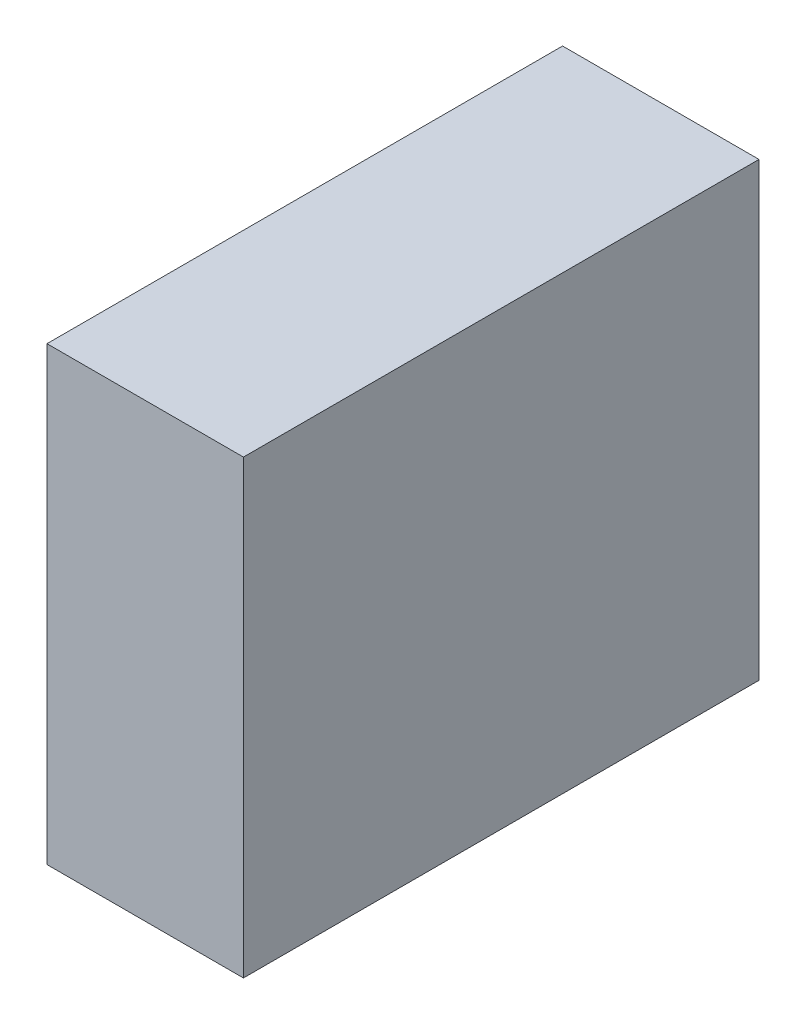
ISO-10303-21;
HEADER;
FILE_DESCRIPTION(('STEP AP214'),'2;1');
FILE_NAME('part.step','',(''),(''),'','','');
FILE_SCHEMA(('AUTOMOTIVE_DESIGN { 1 0 10303 214 1 1 1 1 }'));
ENDSEC;
DATA;
#1=APPLICATION_CONTEXT('core data for automotive mechanical design processes');
#2=APPLICATION_PROTOCOL_DEFINITION('international standard','automotive_design',2000,#1);
#3=PRODUCT_CONTEXT('',#1,'mechanical');
#4=PRODUCT('Part','Part','',(#3));
#5=PRODUCT_RELATED_PRODUCT_CATEGORY('part','',(#4));
#6=PRODUCT_DEFINITION_FORMATION('','',#4);
#7=PRODUCT_DEFINITION_CONTEXT('part definition',#1,'design');
#8=PRODUCT_DEFINITION('design','',#6,#7);
#9=PRODUCT_DEFINITION_SHAPE('','',#8);
#10=(LENGTH_UNIT() NAMED_UNIT(*) SI_UNIT(.MILLI.,.METRE.));
#11=(NAMED_UNIT(*) PLANE_ANGLE_UNIT() SI_UNIT($,.RADIAN.));
#12=(NAMED_UNIT(*) SI_UNIT($,.STERADIAN.) SOLID_ANGLE_UNIT());
#13=UNCERTAINTY_MEASURE_WITH_UNIT(LENGTH_MEASURE(1.E-05),#10,'distance_accuracy_value','');
#14=(GEOMETRIC_REPRESENTATION_CONTEXT(3) GLOBAL_UNCERTAINTY_ASSIGNED_CONTEXT((#13)) GLOBAL_UNIT_ASSIGNED_CONTEXT((#10,
#11,#12)) REPRESENTATION_CONTEXT('',''));
#15=CARTESIAN_POINT('',(0.,0.,0.));
#16=DIRECTION('',(0.,0.,1.));
#17=DIRECTION('',(1.,0.,0.));
#18=AXIS2_PLACEMENT_3D('',#15,#16,#17);
#19=CARTESIAN_POINT('',(0.,0.,1.00000054));
#20=DIRECTION('',(0.,0.,-1.));
#21=DIRECTION('',(0.,-1.,0.));
#22=AXIS2_PLACEMENT_3D('',#19,#20,#21);
#23=PLANE('',#22);
#24=DIRECTION('',(0.,-1.,0.));
#25=VECTOR('',#24,1.);
#26=CARTESIAN_POINT('',(0.1905,0.43749976,1.00000054));
#27=LINE('',#26,#25);
#28=CARTESIAN_POINT('',(0.1905,0.43749976,1.00000054));
#29=VERTEX_POINT('',#28);
#30=CARTESIAN_POINT('',(0.1905,-0.43749976,1.00000054));
#31=VERTEX_POINT('',#30);
#32=EDGE_CURVE('E25',#29,#31,#27,.T.);
#33=ORIENTED_EDGE('',*,*,#32,.F.);
#34=DIRECTION('',(1.,0.,0.));
#35=VECTOR('',#34,1.);
#36=CARTESIAN_POINT('',(-0.1905,0.43749976,1.00000054));
#37=LINE('',#36,#35);
#38=CARTESIAN_POINT('',(-0.1905,0.43749976,1.00000054));
#39=VERTEX_POINT('',#38);
#40=EDGE_CURVE('E101',#39,#29,#37,.T.);
#41=ORIENTED_EDGE('',*,*,#40,.F.);
#42=DIRECTION('',(0.,1.,0.));
#43=VECTOR('',#42,1.);
#44=CARTESIAN_POINT('',(-0.1905,-0.43749976,1.00000054));
#45=LINE('',#44,#43);
#46=CARTESIAN_POINT('',(-0.1905,-0.43749976,1.00000054));
#47=VERTEX_POINT('',#46);
#48=EDGE_CURVE('E83',#47,#39,#45,.T.);
#49=ORIENTED_EDGE('',*,*,#48,.F.);
#50=DIRECTION('',(-1.,0.,0.));
#51=VECTOR('',#50,1.);
#52=CARTESIAN_POINT('',(0.1905,-0.43749976,1.00000054));
#53=LINE('',#52,#51);
#54=EDGE_CURVE('E87',#31,#47,#53,.T.);
#55=ORIENTED_EDGE('',*,*,#54,.F.);
#56=EDGE_LOOP('',(#33,#41,#49,#55));
#57=FACE_BOUND('',#56,.T.);
#58=ADVANCED_FACE('F16',(#57),#23,.F.);
#59=CARTESIAN_POINT('',(0.,0.,0.));
#60=DIRECTION('',(0.,0.,-1.));
#61=DIRECTION('',(0.,-1.,0.));
#62=AXIS2_PLACEMENT_3D('',#59,#60,#61);
#63=PLANE('',#62);
#64=DIRECTION('',(-1.,0.,0.));
#65=VECTOR('',#64,1.);
#66=CARTESIAN_POINT('',(0.1905,-0.43749976,0.));
#67=LINE('',#66,#65);
#68=CARTESIAN_POINT('',(0.1905,-0.43749976,0.));
#69=VERTEX_POINT('',#68);
#70=CARTESIAN_POINT('',(-0.1905,-0.43749976,0.));
#71=VERTEX_POINT('',#70);
#72=EDGE_CURVE('E72',#69,#71,#67,.T.);
#73=ORIENTED_EDGE('',*,*,#72,.T.);
#74=DIRECTION('',(0.,1.,0.));
#75=VECTOR('',#74,1.);
#76=CARTESIAN_POINT('',(-0.1905,-0.43749976,0.));
#77=LINE('',#76,#75);
#78=CARTESIAN_POINT('',(-0.1905,0.43749976,0.));
#79=VERTEX_POINT('',#78);
#80=EDGE_CURVE('E106',#71,#79,#77,.T.);
#81=ORIENTED_EDGE('',*,*,#80,.T.);
#82=DIRECTION('',(1.,0.,0.));
#83=VECTOR('',#82,1.);
#84=CARTESIAN_POINT('',(-0.1905,0.43749976,0.));
#85=LINE('',#84,#83);
#86=CARTESIAN_POINT('',(0.1905,0.43749976,0.));
#87=VERTEX_POINT('',#86);
#88=EDGE_CURVE('E19',#79,#87,#85,.T.);
#89=ORIENTED_EDGE('',*,*,#88,.T.);
#90=DIRECTION('',(0.,-1.,0.));
#91=VECTOR('',#90,1.);
#92=CARTESIAN_POINT('',(0.1905,0.43749976,0.));
#93=LINE('',#92,#91);
#94=EDGE_CURVE('E10',#87,#69,#93,.T.);
#95=ORIENTED_EDGE('',*,*,#94,.T.);
#96=EDGE_LOOP('',(#73,#81,#89,#95));
#97=FACE_BOUND('',#96,.T.);
#98=ADVANCED_FACE('F70',(#97),#63,.T.);
#99=CARTESIAN_POINT('',(0.1905,0.43749976,0.));
#100=DIRECTION('',(1.,0.,0.));
#101=DIRECTION('',(0.,1.,0.));
#102=AXIS2_PLACEMENT_3D('',#99,#100,#101);
#103=PLANE('',#102);
#104=DIRECTION('',(0.,0.,1.));
#105=VECTOR('',#104,1.);
#106=CARTESIAN_POINT('',(0.1905,0.43749976,0.));
#107=LINE('',#106,#105);
#108=EDGE_CURVE('E105',#87,#29,#107,.T.);
#109=ORIENTED_EDGE('',*,*,#108,.T.);
#110=ORIENTED_EDGE('',*,*,#32,.T.);
#111=DIRECTION('',(0.,0.,1.));
#112=VECTOR('',#111,1.);
#113=CARTESIAN_POINT('',(0.1905,-0.43749976,0.));
#114=LINE('',#113,#112);
#115=EDGE_CURVE('E79',#69,#31,#114,.T.);
#116=ORIENTED_EDGE('',*,*,#115,.F.);
#117=ORIENTED_EDGE('',*,*,#94,.F.);
#118=EDGE_LOOP('',(#109,#110,#116,#117));
#119=FACE_BOUND('',#118,.T.);
#120=ADVANCED_FACE('F85',(#119),#103,.T.);
#121=CARTESIAN_POINT('',(-0.1905,0.43749976,0.));
#122=DIRECTION('',(0.,1.,0.));
#123=DIRECTION('',(1.,0.,0.));
#124=AXIS2_PLACEMENT_3D('',#121,#122,#123);
#125=PLANE('',#124);
#126=DIRECTION('',(0.,0.,1.));
#127=VECTOR('',#126,1.);
#128=CARTESIAN_POINT('',(-0.1905,0.43749976,0.));
#129=LINE('',#128,#127);
#130=EDGE_CURVE('E97',#79,#39,#129,.T.);
#131=ORIENTED_EDGE('',*,*,#130,.T.);
#132=ORIENTED_EDGE('',*,*,#40,.T.);
#133=ORIENTED_EDGE('',*,*,#108,.F.);
#134=ORIENTED_EDGE('',*,*,#88,.F.);
#135=EDGE_LOOP('',(#131,#132,#133,#134));
#136=FACE_BOUND('',#135,.T.);
#137=ADVANCED_FACE('F146',(#136),#125,.T.);
#138=CARTESIAN_POINT('',(-0.1905,-0.43749976,0.));
#139=DIRECTION('',(-1.,0.,0.));
#140=DIRECTION('',(0.,0.,1.));
#141=AXIS2_PLACEMENT_3D('',#138,#139,#140);
#142=PLANE('',#141);
#143=DIRECTION('',(0.,0.,1.));
#144=VECTOR('',#143,1.);
#145=CARTESIAN_POINT('',(-0.1905,-0.43749976,0.));
#146=LINE('',#145,#144);
#147=EDGE_CURVE('E81',#71,#47,#146,.T.);
#148=ORIENTED_EDGE('',*,*,#147,.T.);
#149=ORIENTED_EDGE('',*,*,#48,.T.);
#150=ORIENTED_EDGE('',*,*,#130,.F.);
#151=ORIENTED_EDGE('',*,*,#80,.F.);
#152=EDGE_LOOP('',(#148,#149,#150,#151));
#153=FACE_BOUND('',#152,.T.);
#154=ADVANCED_FACE('F136',(#153),#142,.T.);
#155=CARTESIAN_POINT('',(0.1905,-0.43749976,0.));
#156=DIRECTION('',(0.,-1.,0.));
#157=DIRECTION('',(0.,0.,-1.));
#158=AXIS2_PLACEMENT_3D('',#155,#156,#157);
#159=PLANE('',#158);
#160=ORIENTED_EDGE('',*,*,#115,.T.);
#161=ORIENTED_EDGE('',*,*,#54,.T.);
#162=ORIENTED_EDGE('',*,*,#147,.F.);
#163=ORIENTED_EDGE('',*,*,#72,.F.);
#164=EDGE_LOOP('',(#160,#161,#162,#163));
#165=FACE_BOUND('',#164,.T.);
#166=ADVANCED_FACE('F77',(#165),#159,.T.);
#167=CLOSED_SHELL('',(#58,#98,#120,#137,#154,#166));
#168=MANIFOLD_SOLID_BREP('B1',#167);
#169=ADVANCED_BREP_SHAPE_REPRESENTATION('',(#18,#168),#14);
#170=SHAPE_DEFINITION_REPRESENTATION(#9,#169);
ENDSEC;
END-ISO-10303-21;
